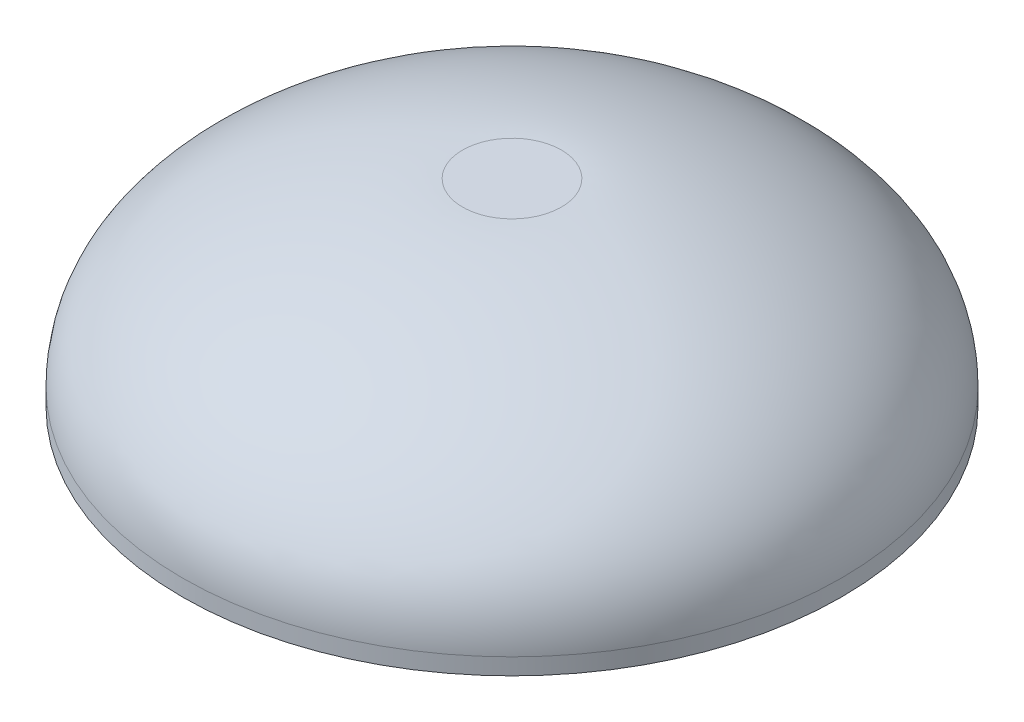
ISO-10303-21;
HEADER;
FILE_DESCRIPTION(('STEP AP214'),'2;1');
FILE_NAME('part.step','',(''),(''),'','','');
FILE_SCHEMA(('AUTOMOTIVE_DESIGN { 1 0 10303 214 1 1 1 1 }'));
ENDSEC;
DATA;
#1=APPLICATION_CONTEXT('core data for automotive mechanical design processes');
#2=APPLICATION_PROTOCOL_DEFINITION('international standard','automotive_design',2000,#1);
#3=PRODUCT_CONTEXT('',#1,'mechanical');
#4=PRODUCT('Part','Part','',(#3));
#5=PRODUCT_RELATED_PRODUCT_CATEGORY('part','',(#4));
#6=PRODUCT_DEFINITION_FORMATION('','',#4);
#7=PRODUCT_DEFINITION_CONTEXT('part definition',#1,'design');
#8=PRODUCT_DEFINITION('design','',#6,#7);
#9=PRODUCT_DEFINITION_SHAPE('','',#8);
#10=(LENGTH_UNIT() NAMED_UNIT(*) SI_UNIT(.MILLI.,.METRE.));
#11=(NAMED_UNIT(*) PLANE_ANGLE_UNIT() SI_UNIT($,.RADIAN.));
#12=(NAMED_UNIT(*) SI_UNIT($,.STERADIAN.) SOLID_ANGLE_UNIT());
#13=UNCERTAINTY_MEASURE_WITH_UNIT(LENGTH_MEASURE(1.E-05),#10,'distance_accuracy_value','');
#14=(GEOMETRIC_REPRESENTATION_CONTEXT(3) GLOBAL_UNCERTAINTY_ASSIGNED_CONTEXT((#13)) GLOBAL_UNIT_ASSIGNED_CONTEXT((#10,
#11,#12)) REPRESENTATION_CONTEXT('',''));
#15=CARTESIAN_POINT('',(0.,0.,0.));
#16=DIRECTION('',(0.,0.,1.));
#17=DIRECTION('',(1.,0.,0.));
#18=AXIS2_PLACEMENT_3D('',#15,#16,#17);
#19=CARTESIAN_POINT('',(0.,0.,0.));
#20=DIRECTION('',(0.,-1.,0.));
#21=DIRECTION('',(0.,0.,-1.));
#22=AXIS2_PLACEMENT_3D('',#19,#20,#21);
#23=PLANE('',#22);
#24=CARTESIAN_POINT('',(0.,0.,0.));
#25=DIRECTION('',(0.,-1.,0.));
#26=DIRECTION('',(0.,0.,-1.));
#27=AXIS2_PLACEMENT_3D('',#24,#25,#26);
#28=CIRCLE('',#27,228.6);
#29=CARTESIAN_POINT('',(0.,0.,-228.6));
#30=VERTEX_POINT('',#29);
#31=EDGE_CURVE('E51',#30,#30,#28,.T.);
#32=ORIENTED_EDGE('',*,*,#31,.F.);
#33=EDGE_LOOP('',(#32));
#34=FACE_BOUND('',#33,.T.);
#35=CARTESIAN_POINT('',(0.,0.,0.));
#36=DIRECTION('',(0.,-1.,0.));
#37=DIRECTION('',(0.,0.,-1.));
#38=AXIS2_PLACEMENT_3D('',#35,#36,#37);
#39=CIRCLE('',#38,254.);
#40=CARTESIAN_POINT('',(0.,0.,-254.));
#41=VERTEX_POINT('',#40);
#42=EDGE_CURVE('E40',#41,#41,#39,.T.);
#43=ORIENTED_EDGE('',*,*,#42,.T.);
#44=EDGE_LOOP('',(#43));
#45=FACE_BOUND('',#44,.T.);
#46=ADVANCED_FACE('F30',(#34,#45),#23,.T.);
#47=CARTESIAN_POINT('',(0.,152.4,0.));
#48=DIRECTION('',(0.,1.,0.));
#49=DIRECTION('',(0.,0.,1.));
#50=AXIS2_PLACEMENT_3D('',#47,#48,#49);
#51=PLANE('',#50);
#52=CARTESIAN_POINT('',(0.,152.4,0.));
#53=DIRECTION('',(0.,-1.,0.));
#54=DIRECTION('',(0.,0.,-1.));
#55=AXIS2_PLACEMENT_3D('',#52,#53,#54);
#56=CIRCLE('',#55,38.1);
#57=CARTESIAN_POINT('',(0.,152.4,-38.1));
#58=VERTEX_POINT('',#57);
#59=EDGE_CURVE('E10',#58,#58,#56,.T.);
#60=ORIENTED_EDGE('',*,*,#59,.F.);
#61=EDGE_LOOP('',(#60));
#62=FACE_BOUND('',#61,.T.);
#63=ADVANCED_FACE('F63',(#62),#51,.T.);
#64=CARTESIAN_POINT('',(254.,12.7,0.));
#65=CARTESIAN_POINT('',(254.,37.4692196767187,0.));
#66=CARTESIAN_POINT('',(214.436347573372,116.005034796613,0.));
#67=CARTESIAN_POINT('',(91.1820581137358,152.4,0.));
#68=CARTESIAN_POINT('',(38.1000000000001,152.4,0.));
#69=B_SPLINE_CURVE_WITH_KNOTS('',3,(#64,#65,#66,#67,#68),.UNSPECIFIED.,.F.,.F.,(4,1,4),(0.,
0.232068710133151,1.),.UNSPECIFIED.);
#70=CARTESIAN_POINT('',(0.,0.,0.));
#71=DIRECTION('',(0.,-1.,0.));
#72=AXIS1_PLACEMENT('',#70,#71);
#73=SURFACE_OF_REVOLUTION('',#69,#72);
#74=ORIENTED_EDGE('',*,*,#59,.T.);
#75=EDGE_LOOP('',(#74));
#76=FACE_BOUND('',#75,.T.);
#77=CARTESIAN_POINT('',(0.,12.7,0.));
#78=DIRECTION('',(0.,-1.,0.));
#79=DIRECTION('',(0.,0.,-1.));
#80=AXIS2_PLACEMENT_3D('',#77,#78,#79);
#81=CIRCLE('',#80,254.);
#82=CARTESIAN_POINT('',(0.,12.7,-254.));
#83=VERTEX_POINT('',#82);
#84=EDGE_CURVE('E36',#83,#83,#81,.T.);
#85=ORIENTED_EDGE('',*,*,#84,.F.);
#86=EDGE_LOOP('',(#85));
#87=FACE_BOUND('',#86,.T.);
#88=ADVANCED_FACE('F57',(#76,#87),#73,.F.);
#89=CARTESIAN_POINT('',(0.,0.,0.));
#90=DIRECTION('',(0.,-1.,0.));
#91=DIRECTION('',(0.,0.,-1.));
#92=AXIS2_PLACEMENT_3D('',#89,#90,#91);
#93=CYLINDRICAL_SURFACE('',#92,254.);
#94=ORIENTED_EDGE('',*,*,#84,.T.);
#95=EDGE_LOOP('',(#94));
#96=FACE_BOUND('',#95,.T.);
#97=ORIENTED_EDGE('',*,*,#42,.F.);
#98=EDGE_LOOP('',(#97));
#99=FACE_BOUND('',#98,.T.);
#100=ADVANCED_FACE('F62',(#96,#99),#93,.T.);
#101=CARTESIAN_POINT('',(0.,127.,0.));
#102=DIRECTION('',(0.,1.,0.));
#103=DIRECTION('',(0.,0.,1.));
#104=AXIS2_PLACEMENT_3D('',#101,#102,#103);
#105=PLANE('',#104);
#106=CARTESIAN_POINT('',(0.,127.,0.));
#107=DIRECTION('',(0.,-1.,0.));
#108=DIRECTION('',(1.,0.,0.));
#109=AXIS2_PLACEMENT_3D('',#106,#107,#108);
#110=CIRCLE('',#109,38.1000000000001);
#111=CARTESIAN_POINT('',(38.1000000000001,127.,0.));
#112=VERTEX_POINT('',#111);
#113=EDGE_CURVE('E44',#112,#112,#110,.T.);
#114=ORIENTED_EDGE('',*,*,#113,.T.);
#115=EDGE_LOOP('',(#114));
#116=FACE_BOUND('',#115,.T.);
#117=ADVANCED_FACE('F71',(#116),#105,.F.);
#118=CARTESIAN_POINT('',(254.,12.7,0.));
#119=CARTESIAN_POINT('',(254.,37.4692196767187,0.));
#120=CARTESIAN_POINT('',(214.436347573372,116.005034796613,0.));
#121=CARTESIAN_POINT('',(91.1820581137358,152.4,0.));
#122=CARTESIAN_POINT('',(38.1000000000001,152.4,0.));
#123=B_SPLINE_CURVE_WITH_KNOTS('',3,(#118,#119,#120,#121,#122),.UNSPECIFIED.,.F.,.F.,(4,1,4),
(0.,0.232068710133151,1.),.UNSPECIFIED.);
#124=CARTESIAN_POINT('',(0.,0.,0.));
#125=DIRECTION('',(0.,-1.,0.));
#126=AXIS1_PLACEMENT('',#124,#125);
#127=SURFACE_OF_REVOLUTION('',#123,#126);
#128=OFFSET_SURFACE('',#127,25.4,.F.);
#129=ORIENTED_EDGE('',*,*,#113,.F.);
#130=EDGE_LOOP('',(#129));
#131=FACE_BOUND('',#130,.T.);
#132=CARTESIAN_POINT('',(0.,12.7,0.));
#133=DIRECTION('',(0.,-1.,0.));
#134=DIRECTION('',(0.,0.,-1.));
#135=AXIS2_PLACEMENT_3D('',#132,#133,#134);
#136=CIRCLE('',#135,228.6);
#137=CARTESIAN_POINT('',(0.,12.7,-228.6));
#138=VERTEX_POINT('',#137);
#139=EDGE_CURVE('E86',#138,#138,#136,.T.);
#140=ORIENTED_EDGE('',*,*,#139,.T.);
#141=EDGE_LOOP('',(#140));
#142=FACE_BOUND('',#141,.T.);
#143=ADVANCED_FACE('F64',(#131,#142),#128,.T.);
#144=CARTESIAN_POINT('',(0.,0.,0.));
#145=DIRECTION('',(0.,-1.,0.));
#146=DIRECTION('',(0.,0.,-1.));
#147=AXIS2_PLACEMENT_3D('',#144,#145,#146);
#148=CYLINDRICAL_SURFACE('',#147,228.6);
#149=ORIENTED_EDGE('',*,*,#139,.F.);
#150=EDGE_LOOP('',(#149));
#151=FACE_BOUND('',#150,.T.);
#152=ORIENTED_EDGE('',*,*,#31,.T.);
#153=EDGE_LOOP('',(#152));
#154=FACE_BOUND('',#153,.T.);
#155=ADVANCED_FACE('F66',(#151,#154),#148,.F.);
#156=CLOSED_SHELL('',(#46,#63,#88,#100,#117,#143,#155));
#157=MANIFOLD_SOLID_BREP('B2',#156);
#158=ADVANCED_BREP_SHAPE_REPRESENTATION('',(#18,#157),#14);
#159=SHAPE_DEFINITION_REPRESENTATION(#9,#158);
ENDSEC;
END-ISO-10303-21;
